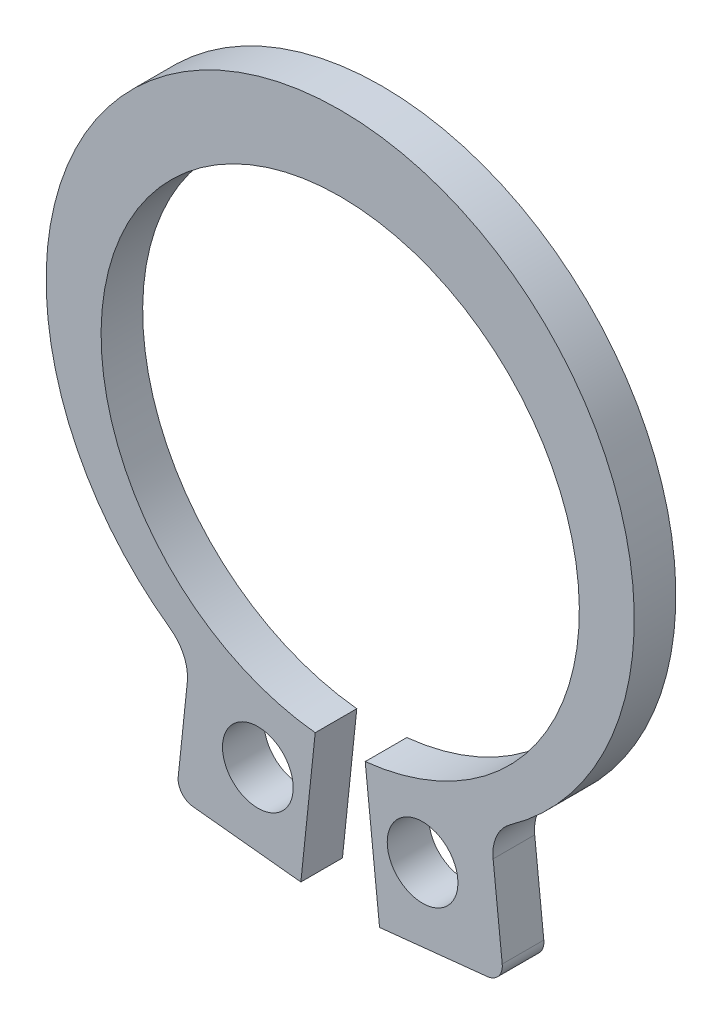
from build123d import *

# Parameters (mm, degrees)
BASE_EXTRUSION_DEPTH    = 1
ENL_V_MAT_EXTRU_1_DEPTH = 1
ENL_V_MAT_EXTRU_2_DEPTH = 1


with BuildPart() as part:
    # Esquisse1 → Base-Extrusion (new body)
    with BuildSketch(Plane.XY):
        with BuildLine():
            Line((-0.601038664, -5.718500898), (-0.945982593, -9.000423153))
            Line((-0.945982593, -9.000423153), (-3.539653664, -8.727817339))
            ThreePointArc((-3.539653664, -8.727817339), (-3.808700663, -8.581736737), (-3.895651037, -8.288197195))
            Line((-3.895651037, -8.288197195), (-3.676913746, -6.207050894))
            ThreePointArc((-3.676913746, -6.207050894), (-3.760154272, -5.690738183), (-4.092637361, -5.287051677))
            ThreePointArc((-4.092637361, -5.287051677), (0, 7.55), (4.092637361, -5.287051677))
            ThreePointArc((4.092637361, -5.287051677), (3.760154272, -5.690738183), (3.676913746, -6.207050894))
            Line((3.676913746, -6.207050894), (3.895651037, -8.288197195))
            ThreePointArc((3.895651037, -8.288197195), (3.808700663, -8.581736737), (3.539653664, -8.727817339))
            Line((3.539653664, -8.727817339), (0.945982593, -9.000423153))
            Line((0.945982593, -9.000423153), (0.601038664, -5.718500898))
            ThreePointArc((0.601038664, -5.718500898), (0, 5.75), (-0.601038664, -5.718500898))
        make_face()
    extrude(amount=BASE_EXTRUSION_DEPTH)

    # Esquisse2 → Enl_v. mat.-Extru.1 (cut)
    with BuildSketch(Plane.XY):
        with BuildLine():
            ThreePointArc((2.830413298, -7.130074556), (1.980413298, -7.980074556), (1.130413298, -7.130074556))
            ThreePointArc((1.130413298, -7.130074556), (1.980413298, -6.280074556), (2.830413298, -7.130074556))
        make_face()
    extrude(amount=ENL_V_MAT_EXTRU_1_DEPTH, mode=Mode.SUBTRACT)

    # Esquisse3 → Enl_v. mat.-Extru.2 (cut)
    with BuildSketch(Plane.XY):
        with BuildLine():
            ThreePointArc((-2.830413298, -7.130074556), (-1.980413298, -6.280074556), (-1.130413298, -7.130074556))
            ThreePointArc((-1.130413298, -7.130074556), (-1.980413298, -7.980074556), (-2.830413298, -7.130074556))
        make_face()
    extrude(amount=ENL_V_MAT_EXTRU_2_DEPTH, mode=Mode.SUBTRACT)


solid = part.part
